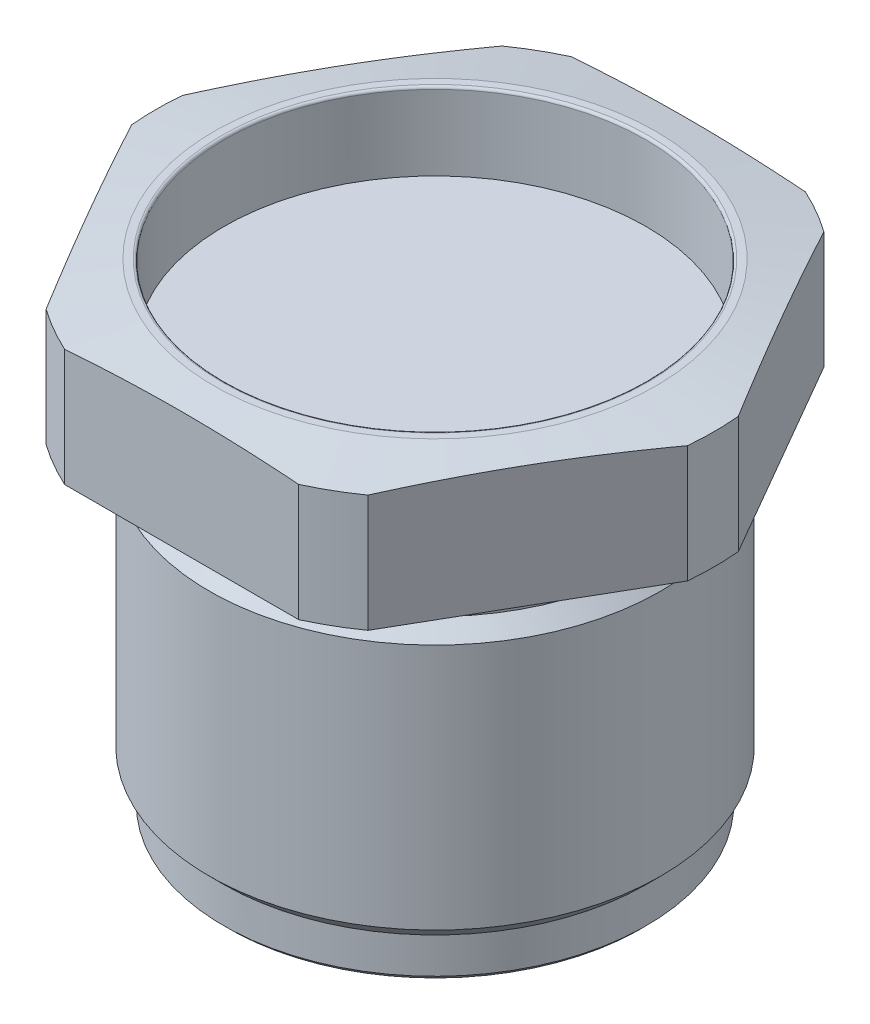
from build123d import *

# Parameters (mm, degrees)
FILLET7_R          = 0.25
SKETCH7_OUTSIDE_W  = 76.01
SKETCH7_OUTSIDE_H  = 76.01
CUT_EXTRUDE5_DEPTH = 53.55059276
CHAMFER2_SIZE      = 0.49999776
FILLET8_R          = 1.016
SKETCH9_W          = 7.5819
SKETCH9_H          = 1.3716


with BuildPart() as part:
    # Sketch6 → Revolve3 (revolve)
    with BuildSketch(Plane.XY, mode=Mode.PRIVATE) as revolve3_sk:
        Polygon((21.0185, 12.7), (21.9964, 12.7), (27.813, 11.674376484), (27.813, 0), (21.0566, 0), (21.0566, -34.8488), (0, -34.8488), (0, 4.9784), (21.0185, 4.9784), align=None)
    revolve(revolve3_sk.sketch.rotate(Axis((0, -8.968942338, 0), (0, 1, 0)), 90), axis=Axis((0, -8.968942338, 0), (0, 1, 0)))

    # Fillet7
    fillet7_edges = [part.edges().sort_by_distance(p)[0] for p in [
        (0, 12.7, 21.0185),
    ]]
    fillet(fillet7_edges, radius=FILLET7_R)

    # Sketch7 outside → Cut-Extrude5 (cut, through all)
    with BuildSketch(Plane.XZ):
        Rectangle(SKETCH7_OUTSIDE_W, SKETCH7_OUTSIDE_H)
        Polygon((-14.578101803, 25.250013), (14.578101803, 25.250013), (29.156203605, 0), (14.578101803, -25.250013), (-14.578101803, -25.250013), (-29.156203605, 0), align=None, mode=Mode.SUBTRACT)
    extrude(amount=-CUT_EXTRUDE5_DEPTH, mode=Mode.SUBTRACT)

    # Chamfer2
    chamfer2_edges = [part.edges().sort_by_distance(p)[0] for p in [
        (0, -34.8488, 21.0566),
    ]]
    chamfer(chamfer2_edges, length=CHAMFER2_SIZE)

    # Sketch8 → Revolve4 (revolve)
    with BuildSketch(Plane.XY, mode=Mode.PRIVATE) as revolve4_sk:
        Polygon((-21.0566, -3.302), (-21.0566, -30.7848), (-22.5, -29.3414), (-22.5, -4.7454), align=None)
    revolve(revolve4_sk.sketch.rotate(Axis((0, 0, 0), (0, -1, 0)), 90), axis=Axis((0, 0, 0), (0, -1, 0)))

    # Fillet8
    fillet8_edges = [part.edges().sort_by_distance(p)[0] for p in [
        (0, 0, 21.0566),
    ]]
    fillet(fillet8_edges, radius=FILLET8_R)

    # Sketch9 → Cut-Revolve1 (revolve, cut)
    with BuildSketch(Plane.XY, mode=Mode.PRIVATE) as cut_revolve1_sk:
        with Locations((3.79095, -34.163)):
            Rectangle(SKETCH9_W, SKETCH9_H)
        with BuildLine():
            Line((9.3853, -34.8488), (9.3853, -34.3154))
            ThreePointArc((9.3853, -34.3154), (9.430920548, -34.596526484), (9.5631, -34.8488))
            Line((9.5631, -34.8488), (9.3853, -34.8488))
        make_face()
        with BuildLine():
            Line((11.1633, -34.3154), (11.1633, -34.8488))
            Line((11.1633, -34.8488), (10.9855, -34.8488))
            ThreePointArc((10.9855, -34.8488), (11.117679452, -34.596526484), (11.1633, -34.3154))
        make_face()
        with BuildLine():
            Line((13.5636, -33.4772), (18.1864, -33.4772))
            ThreePointArc((18.1864, -33.4772), (17.405582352, -33.941176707), (17.439795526, -34.8488))
            Line((17.439795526, -34.8488), (12.192, -34.8488))
            ThreePointArc((12.192, -34.8488), (12.593732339, -33.878932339), (13.5636, -33.4772))
        make_face()
    revolve(cut_revolve1_sk.sketch.rotate(Axis((0, 0, 0), (0, -1, 0)), 180), axis=Axis((0, 0, 0), (0, -1, 0)), mode=Mode.SUBTRACT)

    # Sketch10 → Revolve6 (revolve)
    with BuildSketch(Plane.XY, mode=Mode.PRIVATE) as revolve6_sk:
        with BuildLine():
            Line((-18.933004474, -34.798), (-17.439795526, -34.798))
            ThreePointArc((-17.439795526, -34.798), (-18.1864, -35.2044), (-18.933004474, -34.798))
        make_face()
        with BuildLine():
            Line((-11.020904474, -34.798), (-9.527695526, -34.798))
            ThreePointArc((-9.527695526, -34.798), (-10.2743, -35.2044), (-11.020904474, -34.798))
        make_face()
    revolve(revolve6_sk.sketch.rotate(Axis((0, 0, 0), (0, -1, 0)), 270), axis=Axis((0, 0, 0), (0, -1, 0)))


solid = part.part
